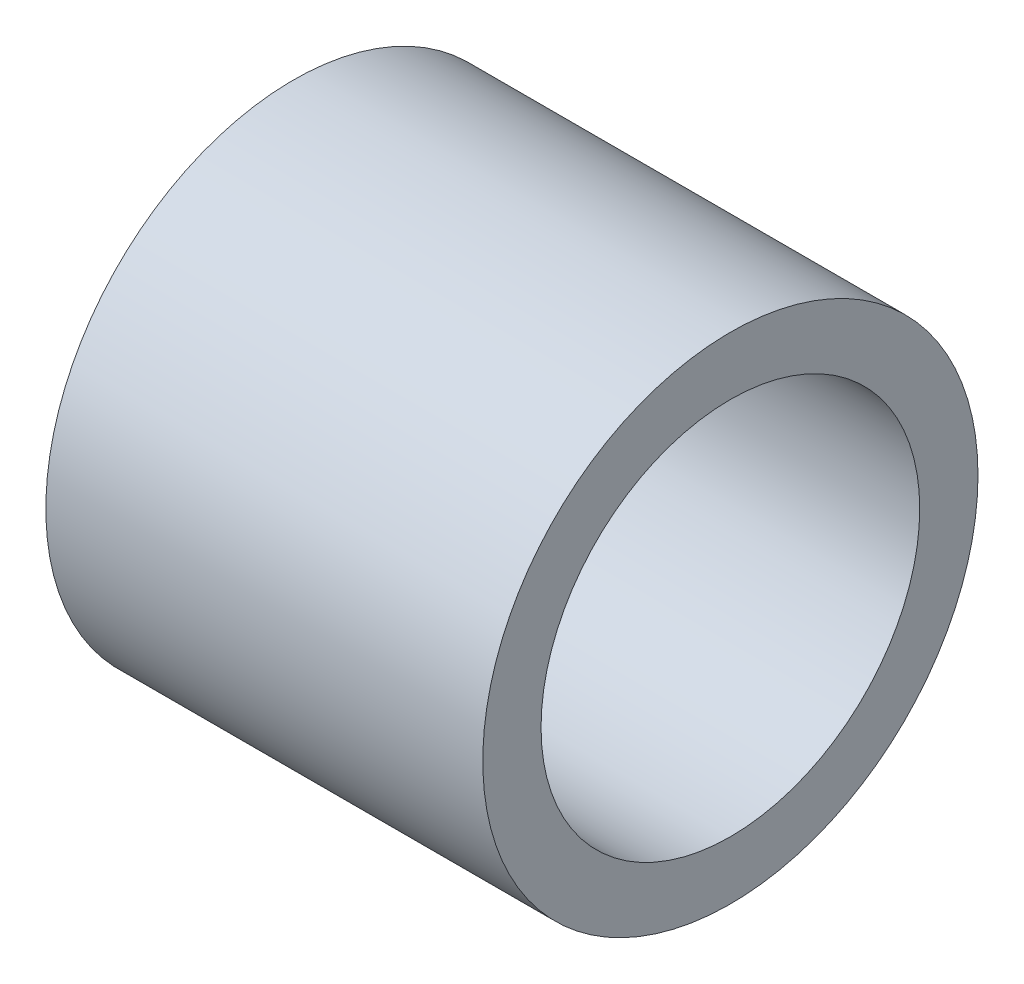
from build123d import *

# Parameters (mm, degrees)
SKETCH1_R           = 8.5
BOSS_EXTRUDE2_DEPTH = 15
SKETCH3_R           = 6.5
CUT_EXTRUDE2_DEPTH  = 20.222382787


with BuildPart() as part:
    # Sketch1 → Boss-Extrude2 (new body)
    with BuildSketch(Plane(origin=(0, 0, 0), x_dir=(0, 0, -1), z_dir=(1, 0, 0))):
        Circle(SKETCH1_R)
    extrude(amount=BOSS_EXTRUDE2_DEPTH)

    # Sketch3 → Cut-Extrude2 (cut, through all)
    with BuildSketch(Plane(origin=(15, 0, 0), x_dir=(0, 0, -1), z_dir=(1, 0, 0))):
        Circle(SKETCH3_R)
    extrude(amount=-CUT_EXTRUDE2_DEPTH, mode=Mode.SUBTRACT)


solid = part.part
